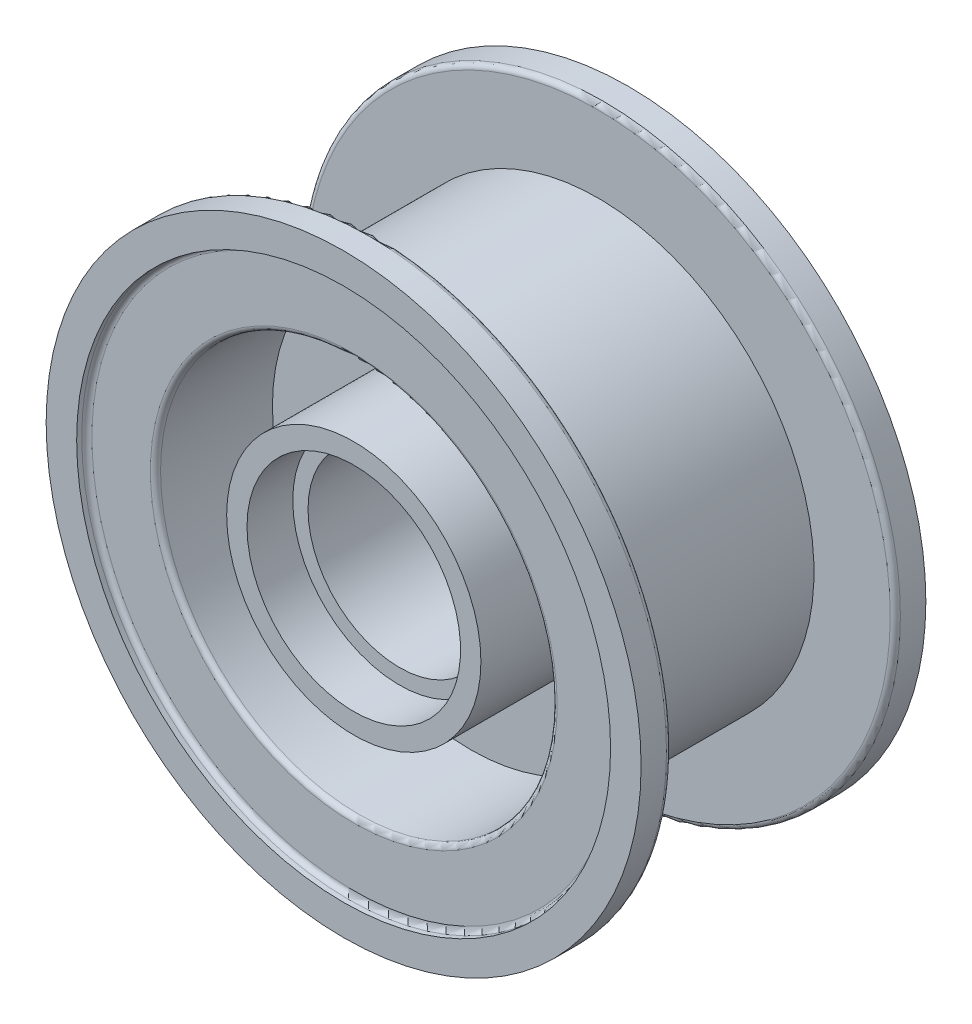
ISO-10303-21;
HEADER;
FILE_DESCRIPTION(('STEP AP214'),'2;1');
FILE_NAME('part.step','',(''),(''),'','','');
FILE_SCHEMA(('AUTOMOTIVE_DESIGN { 1 0 10303 214 1 1 1 1 }'));
ENDSEC;
DATA;
#1=APPLICATION_CONTEXT('core data for automotive mechanical design processes');
#2=APPLICATION_PROTOCOL_DEFINITION('international standard','automotive_design',2000,#1);
#3=PRODUCT_CONTEXT('',#1,'mechanical');
#4=PRODUCT('Part','Part','',(#3));
#5=PRODUCT_RELATED_PRODUCT_CATEGORY('part','',(#4));
#6=PRODUCT_DEFINITION_FORMATION('','',#4);
#7=PRODUCT_DEFINITION_CONTEXT('part definition',#1,'design');
#8=PRODUCT_DEFINITION('design','',#6,#7);
#9=PRODUCT_DEFINITION_SHAPE('','',#8);
#10=(LENGTH_UNIT() NAMED_UNIT(*) SI_UNIT(.MILLI.,.METRE.));
#11=(NAMED_UNIT(*) PLANE_ANGLE_UNIT() SI_UNIT($,.RADIAN.));
#12=(NAMED_UNIT(*) SI_UNIT($,.STERADIAN.) SOLID_ANGLE_UNIT());
#13=UNCERTAINTY_MEASURE_WITH_UNIT(LENGTH_MEASURE(1.E-05),#10,'distance_accuracy_value','');
#14=(GEOMETRIC_REPRESENTATION_CONTEXT(3) GLOBAL_UNCERTAINTY_ASSIGNED_CONTEXT((#13)) GLOBAL_UNIT_ASSIGNED_CONTEXT((#10,
#11,#12)) REPRESENTATION_CONTEXT('',''));
#15=CARTESIAN_POINT('',(0.,0.,0.));
#16=DIRECTION('',(0.,0.,1.));
#17=DIRECTION('',(1.,0.,0.));
#18=AXIS2_PLACEMENT_3D('',#15,#16,#17);
#19=CARTESIAN_POINT('',(0.,0.,26.));
#20=DIRECTION('',(0.,0.,1.));
#21=DIRECTION('',(1.,0.,0.));
#22=AXIS2_PLACEMENT_3D('',#19,#20,#21);
#23=PLANE('',#22);
#24=CARTESIAN_POINT('',(0.,0.,26.));
#25=DIRECTION('',(0.,0.,1.));
#26=DIRECTION('',(1.,0.,0.));
#27=AXIS2_PLACEMENT_3D('',#24,#25,#26);
#28=CIRCLE('',#27,25.);
#29=CARTESIAN_POINT('',(25.,0.,26.));
#30=VERTEX_POINT('',#29);
#31=EDGE_CURVE('E74',#30,#30,#28,.F.);
#32=ORIENTED_EDGE('',*,*,#31,.F.);
#33=EDGE_LOOP('',(#32));
#34=FACE_BOUND('',#33,.T.);
#35=CARTESIAN_POINT('',(0.,0.,26.));
#36=DIRECTION('',(0.,0.,-1.));
#37=DIRECTION('',(-1.,0.,0.));
#38=AXIS2_PLACEMENT_3D('',#35,#36,#37);
#39=CIRCLE('',#38,21.);
#40=CARTESIAN_POINT('',(-21.,0.,26.));
#41=VERTEX_POINT('',#40);
#42=EDGE_CURVE('E121',#41,#41,#39,.T.);
#43=ORIENTED_EDGE('',*,*,#42,.T.);
#44=EDGE_LOOP('',(#43));
#45=FACE_BOUND('',#44,.T.);
#46=ADVANCED_FACE('F29',(#34,#45),#23,.T.);
#47=CARTESIAN_POINT('',(0.,0.,60.));
#48=DIRECTION('',(0.,0.,-1.));
#49=DIRECTION('',(-1.,0.,0.));
#50=AXIS2_PLACEMENT_3D('',#47,#48,#49);
#51=CYLINDRICAL_SURFACE('',#50,18.);
#52=CARTESIAN_POINT('',(0.,0.,-17.));
#53=DIRECTION('',(0.,0.,-1.));
#54=DIRECTION('',(-1.,0.,0.));
#55=AXIS2_PLACEMENT_3D('',#52,#53,#54);
#56=CIRCLE('',#55,18.);
#57=CARTESIAN_POINT('',(-18.,0.,-17.));
#58=VERTEX_POINT('',#57);
#59=EDGE_CURVE('E115',#58,#58,#56,.T.);
#60=ORIENTED_EDGE('',*,*,#59,.T.);
#61=EDGE_LOOP('',(#60));
#62=FACE_BOUND('',#61,.T.);
#63=CARTESIAN_POINT('',(0.,0.,17.));
#64=DIRECTION('',(0.,0.,1.));
#65=DIRECTION('',(1.,0.,0.));
#66=AXIS2_PLACEMENT_3D('',#63,#64,#65);
#67=CIRCLE('',#66,18.);
#68=CARTESIAN_POINT('',(18.,0.,17.));
#69=VERTEX_POINT('',#68);
#70=EDGE_CURVE('E33',#69,#69,#67,.F.);
#71=ORIENTED_EDGE('',*,*,#70,.F.);
#72=EDGE_LOOP('',(#71));
#73=FACE_BOUND('',#72,.T.);
#74=ADVANCED_FACE('F139',(#62,#73),#51,.F.);
#75=CARTESIAN_POINT('',(0.,0.,28.));
#76=DIRECTION('',(0.,0.,-1.));
#77=DIRECTION('',(-1.,0.,0.));
#78=AXIS2_PLACEMENT_3D('',#75,#76,#77);
#79=CYLINDRICAL_SURFACE('',#78,58.5);
#80=CARTESIAN_POINT('',(0.,0.,23.));
#81=DIRECTION('',(0.,0.,-1.));
#82=DIRECTION('',(-1.,0.,0.));
#83=AXIS2_PLACEMENT_3D('',#80,#81,#82);
#84=CIRCLE('',#83,58.5);
#85=CARTESIAN_POINT('',(-58.5,0.,23.));
#86=VERTEX_POINT('',#85);
#87=EDGE_CURVE('E41',#86,#86,#84,.F.);
#88=ORIENTED_EDGE('',*,*,#87,.T.);
#89=EDGE_LOOP('',(#88));
#90=FACE_BOUND('',#89,.T.);
#91=CARTESIAN_POINT('',(0.,0.,28.));
#92=DIRECTION('',(0.,0.,1.));
#93=DIRECTION('',(1.,0.,0.));
#94=AXIS2_PLACEMENT_3D('',#91,#92,#93);
#95=CIRCLE('',#94,58.5);
#96=CARTESIAN_POINT('',(58.5,0.,28.));
#97=VERTEX_POINT('',#96);
#98=EDGE_CURVE('E73',#97,#97,#95,.T.);
#99=ORIENTED_EDGE('',*,*,#98,.F.);
#100=EDGE_LOOP('',(#99));
#101=FACE_BOUND('',#100,.T.);
#102=ADVANCED_FACE('F31',(#90,#101),#79,.T.);
#103=CARTESIAN_POINT('',(0.,0.,-23.));
#104=DIRECTION('',(0.,0.,1.));
#105=DIRECTION('',(1.,0.,0.));
#106=AXIS2_PLACEMENT_3D('',#103,#104,#105);
#107=CIRCLE('',#106,58.5);
#108=CARTESIAN_POINT('',(58.5,0.,-23.));
#109=VERTEX_POINT('',#108);
#110=EDGE_CURVE('E37',#109,#109,#107,.F.);
#111=ORIENTED_EDGE('',*,*,#110,.T.);
#112=EDGE_LOOP('',(#111));
#113=FACE_BOUND('',#112,.T.);
#114=CARTESIAN_POINT('',(0.,0.,-28.));
#115=DIRECTION('',(0.,0.,1.));
#116=DIRECTION('',(1.,0.,0.));
#117=AXIS2_PLACEMENT_3D('',#114,#115,#116);
#118=CIRCLE('',#117,58.5);
#119=CARTESIAN_POINT('',(58.5,0.,-28.));
#120=VERTEX_POINT('',#119);
#121=EDGE_CURVE('E85',#120,#120,#118,.T.);
#122=ORIENTED_EDGE('',*,*,#121,.T.);
#123=EDGE_LOOP('',(#122));
#124=FACE_BOUND('',#123,.T.);
#125=ADVANCED_FACE('F247',(#113,#124),#79,.T.);
#126=CARTESIAN_POINT('',(0.,0.,28.));
#127=DIRECTION('',(0.,0.,1.));
#128=DIRECTION('',(1.,0.,0.));
#129=AXIS2_PLACEMENT_3D('',#126,#127,#128);
#130=PLANE('',#129);
#131=CARTESIAN_POINT('',(0.,0.,28.));
#132=DIRECTION('',(0.,0.,1.));
#133=DIRECTION('',(1.,0.,0.));
#134=AXIS2_PLACEMENT_3D('',#131,#132,#133);
#135=CIRCLE('',#134,52.5);
#136=CARTESIAN_POINT('',(52.5,0.,28.));
#137=VERTEX_POINT('',#136);
#138=EDGE_CURVE('E78',#137,#137,#135,.T.);
#139=ORIENTED_EDGE('',*,*,#138,.F.);
#140=EDGE_LOOP('',(#139));
#141=FACE_BOUND('',#140,.T.);
#142=ORIENTED_EDGE('',*,*,#98,.T.);
#143=EDGE_LOOP('',(#142));
#144=FACE_BOUND('',#143,.T.);
#145=ADVANCED_FACE('F244',(#141,#144),#130,.T.);
#146=CARTESIAN_POINT('',(0.,0.,-28.));
#147=DIRECTION('',(0.,0.,1.));
#148=DIRECTION('',(1.,0.,0.));
#149=AXIS2_PLACEMENT_3D('',#146,#147,#148);
#150=PLANE('',#149);
#151=CARTESIAN_POINT('',(0.,0.,-28.));
#152=DIRECTION('',(0.,0.,-1.));
#153=DIRECTION('',(-1.,0.,0.));
#154=AXIS2_PLACEMENT_3D('',#151,#152,#153);
#155=CIRCLE('',#154,52.5);
#156=CARTESIAN_POINT('',(-52.5,0.,-28.));
#157=VERTEX_POINT('',#156);
#158=EDGE_CURVE('E77',#157,#157,#155,.T.);
#159=ORIENTED_EDGE('',*,*,#158,.F.);
#160=EDGE_LOOP('',(#159));
#161=FACE_BOUND('',#160,.T.);
#162=ORIENTED_EDGE('',*,*,#121,.F.);
#163=EDGE_LOOP('',(#162));
#164=FACE_BOUND('',#163,.T.);
#165=ADVANCED_FACE('F241',(#161,#164),#150,.F.);
#166=CARTESIAN_POINT('',(58.5,0.,22.));
#167=DIRECTION('',(0.,0.,-1.));
#168=DIRECTION('',(-1.,0.,0.));
#169=AXIS2_PLACEMENT_3D('',#166,#167,#168);
#170=PLANE('',#169);
#171=CARTESIAN_POINT('',(0.,0.,22.));
#172=DIRECTION('',(0.,0.,-1.));
#173=DIRECTION('',(-1.,0.,0.));
#174=AXIS2_PLACEMENT_3D('',#171,#172,#173);
#175=CIRCLE('',#174,57.5);
#176=CARTESIAN_POINT('',(-57.5,0.,22.));
#177=VERTEX_POINT('',#176);
#178=EDGE_CURVE('E46',#177,#177,#175,.T.);
#179=ORIENTED_EDGE('',*,*,#178,.T.);
#180=EDGE_LOOP('',(#179));
#181=FACE_BOUND('',#180,.T.);
#182=CARTESIAN_POINT('',(0.,0.,22.));
#183=DIRECTION('',(0.,0.,-1.));
#184=DIRECTION('',(-1.,0.,0.));
#185=AXIS2_PLACEMENT_3D('',#182,#183,#184);
#186=CIRCLE('',#185,42.5);
#187=CARTESIAN_POINT('',(-42.5,0.,22.));
#188=VERTEX_POINT('',#187);
#189=EDGE_CURVE('E88',#188,#188,#186,.T.);
#190=ORIENTED_EDGE('',*,*,#189,.F.);
#191=EDGE_LOOP('',(#190));
#192=FACE_BOUND('',#191,.T.);
#193=ADVANCED_FACE('F237',(#181,#192),#170,.T.);
#194=CARTESIAN_POINT('',(0.,0.,0.));
#195=DIRECTION('',(0.,0.,-1.));
#196=DIRECTION('',(-1.,0.,0.));
#197=AXIS2_PLACEMENT_3D('',#194,#195,#196);
#198=CYLINDRICAL_SURFACE('',#197,42.5);
#199=ORIENTED_EDGE('',*,*,#189,.T.);
#200=EDGE_LOOP('',(#199));
#201=FACE_BOUND('',#200,.T.);
#202=CARTESIAN_POINT('',(0.,0.,-22.));
#203=DIRECTION('',(0.,0.,-1.));
#204=DIRECTION('',(-1.,0.,0.));
#205=AXIS2_PLACEMENT_3D('',#202,#203,#204);
#206=CIRCLE('',#205,42.5);
#207=CARTESIAN_POINT('',(-42.5,0.,-22.));
#208=VERTEX_POINT('',#207);
#209=EDGE_CURVE('E91',#208,#208,#206,.T.);
#210=ORIENTED_EDGE('',*,*,#209,.F.);
#211=EDGE_LOOP('',(#210));
#212=FACE_BOUND('',#211,.T.);
#213=ADVANCED_FACE('F234',(#201,#212),#198,.T.);
#214=CARTESIAN_POINT('',(58.5,0.,-22.));
#215=DIRECTION('',(0.,0.,1.));
#216=DIRECTION('',(1.,0.,0.));
#217=AXIS2_PLACEMENT_3D('',#214,#215,#216);
#218=PLANE('',#217);
#219=CARTESIAN_POINT('',(0.,0.,-22.));
#220=DIRECTION('',(0.,0.,1.));
#221=DIRECTION('',(1.,0.,0.));
#222=AXIS2_PLACEMENT_3D('',#219,#220,#221);
#223=CIRCLE('',#222,57.5);
#224=CARTESIAN_POINT('',(57.5,0.,-22.));
#225=VERTEX_POINT('',#224);
#226=EDGE_CURVE('E10',#225,#225,#223,.T.);
#227=ORIENTED_EDGE('',*,*,#226,.T.);
#228=EDGE_LOOP('',(#227));
#229=FACE_BOUND('',#228,.T.);
#230=ORIENTED_EDGE('',*,*,#209,.T.);
#231=EDGE_LOOP('',(#230));
#232=FACE_BOUND('',#231,.T.);
#233=ADVANCED_FACE('F217',(#229,#232),#218,.T.);
#234=CARTESIAN_POINT('',(0.,0.,-26.));
#235=DIRECTION('',(0.,0.,-1.));
#236=DIRECTION('',(-1.,0.,0.));
#237=AXIS2_PLACEMENT_3D('',#234,#235,#236);
#238=PLANE('',#237);
#239=CARTESIAN_POINT('',(0.,0.,-26.));
#240=DIRECTION('',(0.,0.,-1.));
#241=DIRECTION('',(-1.,0.,0.));
#242=AXIS2_PLACEMENT_3D('',#239,#240,#241);
#243=CIRCLE('',#242,21.);
#244=CARTESIAN_POINT('',(-21.,0.,-26.));
#245=VERTEX_POINT('',#244);
#246=EDGE_CURVE('E112',#245,#245,#243,.T.);
#247=ORIENTED_EDGE('',*,*,#246,.F.);
#248=EDGE_LOOP('',(#247));
#249=FACE_BOUND('',#248,.T.);
#250=CARTESIAN_POINT('',(0.,0.,-26.));
#251=DIRECTION('',(0.,0.,-1.));
#252=DIRECTION('',(-1.,0.,0.));
#253=AXIS2_PLACEMENT_3D('',#250,#251,#252);
#254=CIRCLE('',#253,25.);
#255=CARTESIAN_POINT('',(-25.,0.,-26.));
#256=VERTEX_POINT('',#255);
#257=EDGE_CURVE('E79',#256,#256,#254,.F.);
#258=ORIENTED_EDGE('',*,*,#257,.F.);
#259=EDGE_LOOP('',(#258));
#260=FACE_BOUND('',#259,.T.);
#261=ADVANCED_FACE('F206',(#249,#260),#238,.T.);
#262=CARTESIAN_POINT('',(0.,0.,-26.));
#263=DIRECTION('',(0.,0.,-1.));
#264=DIRECTION('',(-1.,0.,0.));
#265=AXIS2_PLACEMENT_3D('',#262,#263,#264);
#266=CIRCLE('',#265,40.);
#267=CARTESIAN_POINT('',(-40.,0.,-26.));
#268=VERTEX_POINT('',#267);
#269=EDGE_CURVE('E67',#268,#268,#266,.F.);
#270=ORIENTED_EDGE('',*,*,#269,.T.);
#271=EDGE_LOOP('',(#270));
#272=FACE_BOUND('',#271,.T.);
#273=CARTESIAN_POINT('',(0.,0.,-26.));
#274=DIRECTION('',(0.,0.,-1.));
#275=DIRECTION('',(-1.,0.,0.));
#276=AXIS2_PLACEMENT_3D('',#273,#274,#275);
#277=CIRCLE('',#276,51.5);
#278=CARTESIAN_POINT('',(-51.5,0.,-26.));
#279=VERTEX_POINT('',#278);
#280=EDGE_CURVE('E70',#279,#279,#277,.T.);
#281=ORIENTED_EDGE('',*,*,#280,.T.);
#282=EDGE_LOOP('',(#281));
#283=FACE_BOUND('',#282,.T.);
#284=ADVANCED_FACE('F202',(#272,#283),#238,.T.);
#285=CARTESIAN_POINT('',(0.,0.,-26.));
#286=DIRECTION('',(0.,0.,-1.));
#287=DIRECTION('',(-1.,0.,0.));
#288=AXIS2_PLACEMENT_3D('',#285,#286,#287);
#289=CYLINDRICAL_SURFACE('',#288,52.5);
#290=CARTESIAN_POINT('',(0.,0.,-27.));
#291=DIRECTION('',(0.,0.,-1.));
#292=DIRECTION('',(-1.,0.,0.));
#293=AXIS2_PLACEMENT_3D('',#290,#291,#292);
#294=CIRCLE('',#293,52.5);
#295=CARTESIAN_POINT('',(-52.5,0.,-27.));
#296=VERTEX_POINT('',#295);
#297=EDGE_CURVE('E61',#296,#296,#294,.F.);
#298=ORIENTED_EDGE('',*,*,#297,.T.);
#299=EDGE_LOOP('',(#298));
#300=FACE_BOUND('',#299,.T.);
#301=ORIENTED_EDGE('',*,*,#158,.T.);
#302=EDGE_LOOP('',(#301));
#303=FACE_BOUND('',#302,.T.);
#304=ADVANCED_FACE('F205',(#300,#303),#289,.F.);
#305=CARTESIAN_POINT('',(0.,0.,-3.));
#306=DIRECTION('',(0.,0.,-1.));
#307=DIRECTION('',(-1.,0.,0.));
#308=AXIS2_PLACEMENT_3D('',#305,#306,#307);
#309=CYLINDRICAL_SURFACE('',#308,39.);
#310=CARTESIAN_POINT('',(0.,0.,-25.));
#311=DIRECTION('',(0.,0.,-1.));
#312=DIRECTION('',(-1.,0.,0.));
#313=AXIS2_PLACEMENT_3D('',#310,#311,#312);
#314=CIRCLE('',#313,39.);
#315=CARTESIAN_POINT('',(-39.,0.,-25.));
#316=VERTEX_POINT('',#315);
#317=EDGE_CURVE('E64',#316,#316,#314,.T.);
#318=ORIENTED_EDGE('',*,*,#317,.T.);
#319=EDGE_LOOP('',(#318));
#320=FACE_BOUND('',#319,.T.);
#321=CARTESIAN_POINT('',(0.,0.,-3.));
#322=DIRECTION('',(0.,0.,-1.));
#323=DIRECTION('',(-1.,0.,0.));
#324=AXIS2_PLACEMENT_3D('',#321,#322,#323);
#325=CIRCLE('',#324,39.);
#326=CARTESIAN_POINT('',(-39.,0.,-3.));
#327=VERTEX_POINT('',#326);
#328=EDGE_CURVE('E100',#327,#327,#325,.T.);
#329=ORIENTED_EDGE('',*,*,#328,.F.);
#330=EDGE_LOOP('',(#329));
#331=FACE_BOUND('',#330,.T.);
#332=ADVANCED_FACE('F214',(#320,#331),#309,.F.);
#333=CARTESIAN_POINT('',(0.,0.,-3.));
#334=DIRECTION('',(0.,0.,-1.));
#335=DIRECTION('',(-1.,0.,0.));
#336=AXIS2_PLACEMENT_3D('',#333,#334,#335);
#337=PLANE('',#336);
#338=CARTESIAN_POINT('',(0.,0.,-3.));
#339=DIRECTION('',(0.,0.,-1.));
#340=DIRECTION('',(-1.,0.,0.));
#341=AXIS2_PLACEMENT_3D('',#338,#339,#340);
#342=CIRCLE('',#341,25.);
#343=CARTESIAN_POINT('',(-25.,0.,-3.));
#344=VERTEX_POINT('',#343);
#345=EDGE_CURVE('E82',#344,#344,#342,.T.);
#346=ORIENTED_EDGE('',*,*,#345,.F.);
#347=EDGE_LOOP('',(#346));
#348=FACE_BOUND('',#347,.T.);
#349=ORIENTED_EDGE('',*,*,#328,.T.);
#350=EDGE_LOOP('',(#349));
#351=FACE_BOUND('',#350,.T.);
#352=ADVANCED_FACE('F160',(#348,#351),#337,.T.);
#353=CARTESIAN_POINT('',(0.,0.,-3.));
#354=DIRECTION('',(0.,0.,-1.));
#355=DIRECTION('',(-1.,0.,0.));
#356=AXIS2_PLACEMENT_3D('',#353,#354,#355);
#357=CYLINDRICAL_SURFACE('',#356,25.);
#358=ORIENTED_EDGE('',*,*,#345,.T.);
#359=EDGE_LOOP('',(#358));
#360=FACE_BOUND('',#359,.T.);
#361=ORIENTED_EDGE('',*,*,#257,.T.);
#362=EDGE_LOOP('',(#361));
#363=FACE_BOUND('',#362,.T.);
#364=ADVANCED_FACE('F152',(#360,#363),#357,.T.);
#365=CARTESIAN_POINT('',(0.,0.,26.));
#366=DIRECTION('',(0.,0.,1.));
#367=DIRECTION('',(1.,0.,0.));
#368=AXIS2_PLACEMENT_3D('',#365,#366,#367);
#369=CIRCLE('',#368,40.);
#370=CARTESIAN_POINT('',(40.,0.,26.));
#371=VERTEX_POINT('',#370);
#372=EDGE_CURVE('E55',#371,#371,#369,.F.);
#373=ORIENTED_EDGE('',*,*,#372,.T.);
#374=EDGE_LOOP('',(#373));
#375=FACE_BOUND('',#374,.T.);
#376=CARTESIAN_POINT('',(0.,0.,26.));
#377=DIRECTION('',(0.,0.,1.));
#378=DIRECTION('',(1.,0.,0.));
#379=AXIS2_PLACEMENT_3D('',#376,#377,#378);
#380=CIRCLE('',#379,51.5);
#381=CARTESIAN_POINT('',(51.5,0.,26.));
#382=VERTEX_POINT('',#381);
#383=EDGE_CURVE('E58',#382,#382,#380,.T.);
#384=ORIENTED_EDGE('',*,*,#383,.T.);
#385=EDGE_LOOP('',(#384));
#386=FACE_BOUND('',#385,.T.);
#387=ADVANCED_FACE('F142',(#375,#386),#23,.T.);
#388=CARTESIAN_POINT('',(0.,0.,26.));
#389=DIRECTION('',(0.,0.,1.));
#390=DIRECTION('',(1.,0.,0.));
#391=AXIS2_PLACEMENT_3D('',#388,#389,#390);
#392=CYLINDRICAL_SURFACE('',#391,52.5);
#393=CARTESIAN_POINT('',(0.,0.,27.));
#394=DIRECTION('',(0.,0.,1.));
#395=DIRECTION('',(1.,0.,0.));
#396=AXIS2_PLACEMENT_3D('',#393,#394,#395);
#397=CIRCLE('',#396,52.5);
#398=CARTESIAN_POINT('',(52.5,0.,27.));
#399=VERTEX_POINT('',#398);
#400=EDGE_CURVE('E49',#399,#399,#397,.F.);
#401=ORIENTED_EDGE('',*,*,#400,.T.);
#402=EDGE_LOOP('',(#401));
#403=FACE_BOUND('',#402,.T.);
#404=ORIENTED_EDGE('',*,*,#138,.T.);
#405=EDGE_LOOP('',(#404));
#406=FACE_BOUND('',#405,.T.);
#407=ADVANCED_FACE('F151',(#403,#406),#392,.F.);
#408=CARTESIAN_POINT('',(0.,0.,3.));
#409=DIRECTION('',(0.,0.,1.));
#410=DIRECTION('',(1.,0.,0.));
#411=AXIS2_PLACEMENT_3D('',#408,#409,#410);
#412=CYLINDRICAL_SURFACE('',#411,39.);
#413=CARTESIAN_POINT('',(0.,0.,25.));
#414=DIRECTION('',(0.,0.,1.));
#415=DIRECTION('',(1.,0.,0.));
#416=AXIS2_PLACEMENT_3D('',#413,#414,#415);
#417=CIRCLE('',#416,39.);
#418=CARTESIAN_POINT('',(39.,0.,25.));
#419=VERTEX_POINT('',#418);
#420=EDGE_CURVE('E52',#419,#419,#417,.T.);
#421=ORIENTED_EDGE('',*,*,#420,.T.);
#422=EDGE_LOOP('',(#421));
#423=FACE_BOUND('',#422,.T.);
#424=CARTESIAN_POINT('',(0.,0.,3.));
#425=DIRECTION('',(0.,0.,1.));
#426=DIRECTION('',(1.,0.,0.));
#427=AXIS2_PLACEMENT_3D('',#424,#425,#426);
#428=CIRCLE('',#427,39.);
#429=CARTESIAN_POINT('',(39.,0.,3.));
#430=VERTEX_POINT('',#429);
#431=EDGE_CURVE('E94',#430,#430,#428,.T.);
#432=ORIENTED_EDGE('',*,*,#431,.F.);
#433=EDGE_LOOP('',(#432));
#434=FACE_BOUND('',#433,.T.);
#435=ADVANCED_FACE('F158',(#423,#434),#412,.F.);
#436=CARTESIAN_POINT('',(0.,0.,3.));
#437=DIRECTION('',(0.,0.,1.));
#438=DIRECTION('',(1.,0.,0.));
#439=AXIS2_PLACEMENT_3D('',#436,#437,#438);
#440=PLANE('',#439);
#441=CARTESIAN_POINT('',(0.,0.,3.));
#442=DIRECTION('',(0.,0.,1.));
#443=DIRECTION('',(1.,0.,0.));
#444=AXIS2_PLACEMENT_3D('',#441,#442,#443);
#445=CIRCLE('',#444,25.);
#446=CARTESIAN_POINT('',(25.,0.,3.));
#447=VERTEX_POINT('',#446);
#448=EDGE_CURVE('E97',#447,#447,#445,.T.);
#449=ORIENTED_EDGE('',*,*,#448,.F.);
#450=EDGE_LOOP('',(#449));
#451=FACE_BOUND('',#450,.T.);
#452=ORIENTED_EDGE('',*,*,#431,.T.);
#453=EDGE_LOOP('',(#452));
#454=FACE_BOUND('',#453,.T.);
#455=ADVANCED_FACE('F195',(#451,#454),#440,.T.);
#456=CARTESIAN_POINT('',(0.,0.,3.));
#457=DIRECTION('',(0.,0.,1.));
#458=DIRECTION('',(1.,0.,0.));
#459=AXIS2_PLACEMENT_3D('',#456,#457,#458);
#460=CYLINDRICAL_SURFACE('',#459,25.);
#461=ORIENTED_EDGE('',*,*,#448,.T.);
#462=EDGE_LOOP('',(#461));
#463=FACE_BOUND('',#462,.T.);
#464=ORIENTED_EDGE('',*,*,#31,.T.);
#465=EDGE_LOOP('',(#464));
#466=FACE_BOUND('',#465,.T.);
#467=ADVANCED_FACE('F190',(#463,#466),#460,.T.);
#468=CARTESIAN_POINT('',(0.,0.,-25.));
#469=DIRECTION('',(0.,0.,-1.));
#470=DIRECTION('',(-1.,0.,0.));
#471=AXIS2_PLACEMENT_3D('',#468,#469,#470);
#472=TOROIDAL_SURFACE('',#471,40.,1.);
#473=ORIENTED_EDGE('',*,*,#317,.F.);
#474=EDGE_LOOP('',(#473));
#475=FACE_BOUND('',#474,.T.);
#476=ORIENTED_EDGE('',*,*,#269,.F.);
#477=EDGE_LOOP('',(#476));
#478=FACE_BOUND('',#477,.T.);
#479=ADVANCED_FACE('F187',(#475,#478),#472,.T.);
#480=CARTESIAN_POINT('',(0.,0.,-27.));
#481=DIRECTION('',(0.,0.,-1.));
#482=DIRECTION('',(-1.,0.,0.));
#483=AXIS2_PLACEMENT_3D('',#480,#481,#482);
#484=TOROIDAL_SURFACE('',#483,51.5,1.);
#485=ORIENTED_EDGE('',*,*,#297,.F.);
#486=EDGE_LOOP('',(#485));
#487=FACE_BOUND('',#486,.T.);
#488=ORIENTED_EDGE('',*,*,#280,.F.);
#489=EDGE_LOOP('',(#488));
#490=FACE_BOUND('',#489,.T.);
#491=ADVANCED_FACE('F180',(#487,#490),#484,.F.);
#492=CARTESIAN_POINT('',(0.,0.,25.));
#493=DIRECTION('',(0.,0.,1.));
#494=DIRECTION('',(1.,0.,0.));
#495=AXIS2_PLACEMENT_3D('',#492,#493,#494);
#496=TOROIDAL_SURFACE('',#495,40.,1.);
#497=ORIENTED_EDGE('',*,*,#420,.F.);
#498=EDGE_LOOP('',(#497));
#499=FACE_BOUND('',#498,.T.);
#500=ORIENTED_EDGE('',*,*,#372,.F.);
#501=EDGE_LOOP('',(#500));
#502=FACE_BOUND('',#501,.T.);
#503=ADVANCED_FACE('F170',(#499,#502),#496,.T.);
#504=CARTESIAN_POINT('',(0.,0.,27.));
#505=DIRECTION('',(0.,0.,1.));
#506=DIRECTION('',(1.,0.,0.));
#507=AXIS2_PLACEMENT_3D('',#504,#505,#506);
#508=TOROIDAL_SURFACE('',#507,51.5,1.);
#509=ORIENTED_EDGE('',*,*,#400,.F.);
#510=EDGE_LOOP('',(#509));
#511=FACE_BOUND('',#510,.T.);
#512=ORIENTED_EDGE('',*,*,#383,.F.);
#513=EDGE_LOOP('',(#512));
#514=FACE_BOUND('',#513,.T.);
#515=ADVANCED_FACE('F167',(#511,#514),#508,.F.);
#516=CARTESIAN_POINT('',(0.,0.,23.));
#517=DIRECTION('',(0.,0.,-1.));
#518=DIRECTION('',(-1.,0.,0.));
#519=AXIS2_PLACEMENT_3D('',#516,#517,#518);
#520=TOROIDAL_SURFACE('',#519,57.5,1.);
#521=ORIENTED_EDGE('',*,*,#87,.F.);
#522=EDGE_LOOP('',(#521));
#523=FACE_BOUND('',#522,.T.);
#524=ORIENTED_EDGE('',*,*,#178,.F.);
#525=EDGE_LOOP('',(#524));
#526=FACE_BOUND('',#525,.T.);
#527=ADVANCED_FACE('F169',(#523,#526),#520,.T.);
#528=CARTESIAN_POINT('',(0.,0.,-23.));
#529=DIRECTION('',(0.,0.,1.));
#530=DIRECTION('',(1.,0.,0.));
#531=AXIS2_PLACEMENT_3D('',#528,#529,#530);
#532=TOROIDAL_SURFACE('',#531,57.5,1.);
#533=ORIENTED_EDGE('',*,*,#226,.F.);
#534=EDGE_LOOP('',(#533));
#535=FACE_BOUND('',#534,.T.);
#536=ORIENTED_EDGE('',*,*,#110,.F.);
#537=EDGE_LOOP('',(#536));
#538=FACE_BOUND('',#537,.T.);
#539=ADVANCED_FACE('F177',(#535,#538),#532,.T.);
#540=CARTESIAN_POINT('',(0.,0.,-17.));
#541=DIRECTION('',(0.,0.,-1.));
#542=DIRECTION('',(-1.,0.,0.));
#543=AXIS2_PLACEMENT_3D('',#540,#541,#542);
#544=PLANE('',#543);
#545=ORIENTED_EDGE('',*,*,#59,.F.);
#546=EDGE_LOOP('',(#545));
#547=FACE_BOUND('',#546,.T.);
#548=CARTESIAN_POINT('',(0.,0.,-17.));
#549=DIRECTION('',(0.,0.,-1.));
#550=DIRECTION('',(-1.,0.,0.));
#551=AXIS2_PLACEMENT_3D('',#548,#549,#550);
#552=CIRCLE('',#551,21.);
#553=CARTESIAN_POINT('',(-21.,0.,-17.));
#554=VERTEX_POINT('',#553);
#555=EDGE_CURVE('E109',#554,#554,#552,.T.);
#556=ORIENTED_EDGE('',*,*,#555,.T.);
#557=EDGE_LOOP('',(#556));
#558=FACE_BOUND('',#557,.T.);
#559=ADVANCED_FACE('F306',(#547,#558),#544,.T.);
#560=CARTESIAN_POINT('',(0.,0.,-17.));
#561=DIRECTION('',(0.,0.,-1.));
#562=DIRECTION('',(-1.,0.,0.));
#563=AXIS2_PLACEMENT_3D('',#560,#561,#562);
#564=CYLINDRICAL_SURFACE('',#563,21.);
#565=ORIENTED_EDGE('',*,*,#555,.F.);
#566=EDGE_LOOP('',(#565));
#567=FACE_BOUND('',#566,.T.);
#568=ORIENTED_EDGE('',*,*,#246,.T.);
#569=EDGE_LOOP('',(#568));
#570=FACE_BOUND('',#569,.T.);
#571=ADVANCED_FACE('F134',(#567,#570),#564,.F.);
#572=CARTESIAN_POINT('',(0.,0.,17.));
#573=DIRECTION('',(0.,0.,1.));
#574=DIRECTION('',(-1.,0.,0.));
#575=AXIS2_PLACEMENT_3D('',#572,#573,#574);
#576=PLANE('',#575);
#577=CARTESIAN_POINT('',(0.,0.,17.));
#578=DIRECTION('',(0.,0.,-1.));
#579=DIRECTION('',(-1.,0.,0.));
#580=AXIS2_PLACEMENT_3D('',#577,#578,#579);
#581=CIRCLE('',#580,21.);
#582=CARTESIAN_POINT('',(-21.,0.,17.));
#583=VERTEX_POINT('',#582);
#584=EDGE_CURVE('E118',#583,#583,#581,.T.);
#585=ORIENTED_EDGE('',*,*,#584,.F.);
#586=EDGE_LOOP('',(#585));
#587=FACE_BOUND('',#586,.T.);
#588=ORIENTED_EDGE('',*,*,#70,.T.);
#589=EDGE_LOOP('',(#588));
#590=FACE_BOUND('',#589,.T.);
#591=ADVANCED_FACE('F128',(#587,#590),#576,.T.);
#592=CARTESIAN_POINT('',(0.,0.,17.));
#593=DIRECTION('',(0.,0.,1.));
#594=DIRECTION('',(1.,0.,0.));
#595=AXIS2_PLACEMENT_3D('',#592,#593,#594);
#596=CYLINDRICAL_SURFACE('',#595,21.);
#597=ORIENTED_EDGE('',*,*,#584,.T.);
#598=EDGE_LOOP('',(#597));
#599=FACE_BOUND('',#598,.T.);
#600=ORIENTED_EDGE('',*,*,#42,.F.);
#601=EDGE_LOOP('',(#600));
#602=FACE_BOUND('',#601,.T.);
#603=ADVANCED_FACE('F126',(#599,#602),#596,.F.);
#604=CLOSED_SHELL('',(#46,#74,#102,#125,#145,#165,#193,#213,#233,#261,#284,#304,#332,#352,#364,
#387,#407,#435,#455,#467,#479,#491,#503,#515,#527,#539,#559,#571,#591,#603));
#605=MANIFOLD_SOLID_BREP('B2',#604);
#606=ADVANCED_BREP_SHAPE_REPRESENTATION('',(#18,#605),#14);
#607=SHAPE_DEFINITION_REPRESENTATION(#9,#606);
ENDSEC;
END-ISO-10303-21;
